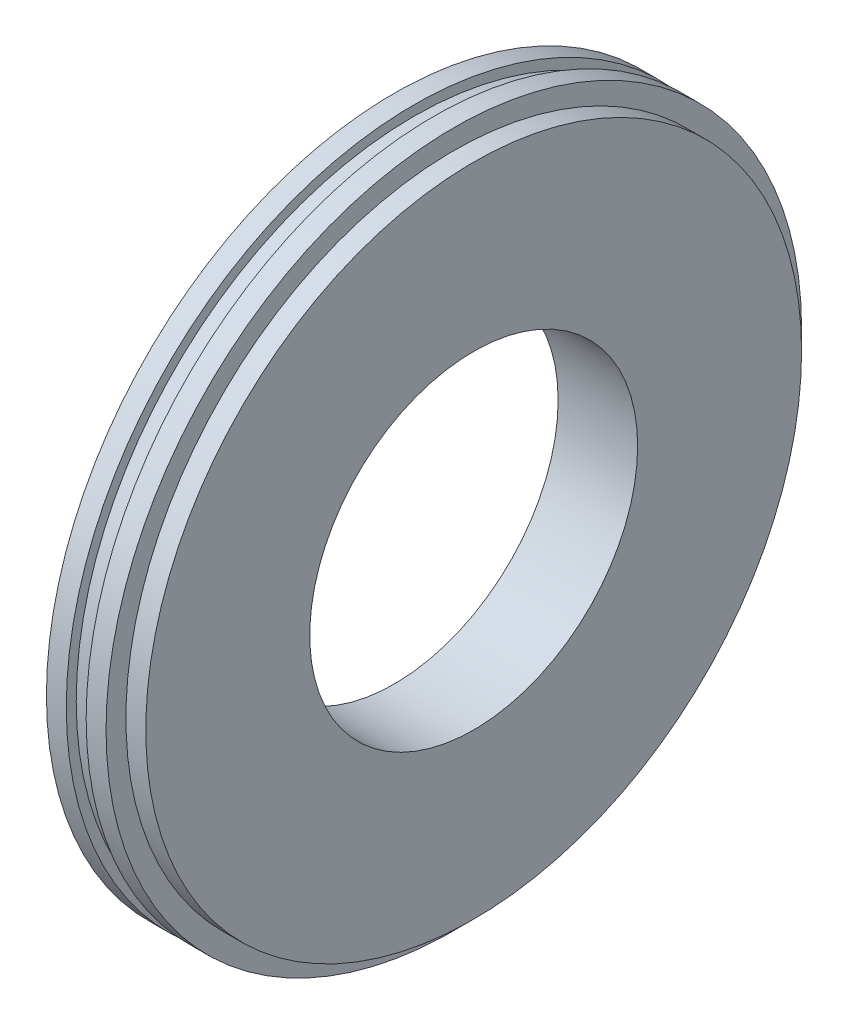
from build123d import *


with BuildPart() as part:
    # Sketch11 → Revolve1 (revolve)
    with BuildSketch(Plane.XY, mode=Mode.PRIVATE) as revolve1_sk:
        Polygon((0, 16.5), (0, 35), (2, 35), (2, 34), (4, 34), (4, 35), (6, 35), (6, 33), (8, 33), (8, 16.5), align=None)
    revolve(revolve1_sk.sketch.rotate(Axis((8.4, 0, 0), (-1, 0, 0)), 90), axis=Axis((8.4, 0, 0), (-1, 0, 0)))


solid = part.part
